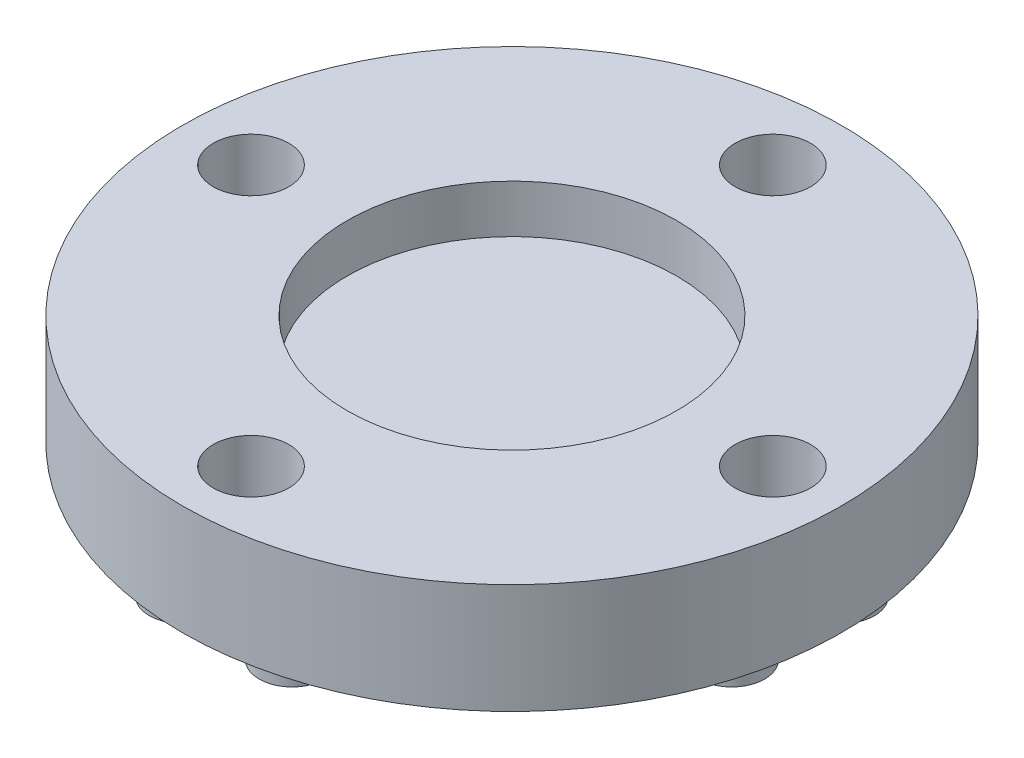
ISO-10303-21;
HEADER;
FILE_DESCRIPTION(('STEP AP214'),'2;1');
FILE_NAME('part.step','',(''),(''),'','','');
FILE_SCHEMA(('AUTOMOTIVE_DESIGN { 1 0 10303 214 1 1 1 1 }'));
ENDSEC;
DATA;
#1=APPLICATION_CONTEXT('core data for automotive mechanical design processes');
#2=APPLICATION_PROTOCOL_DEFINITION('international standard','automotive_design',2000,#1);
#3=PRODUCT_CONTEXT('',#1,'mechanical');
#4=PRODUCT('Part','Part','',(#3));
#5=PRODUCT_RELATED_PRODUCT_CATEGORY('part','',(#4));
#6=PRODUCT_DEFINITION_FORMATION('','',#4);
#7=PRODUCT_DEFINITION_CONTEXT('part definition',#1,'design');
#8=PRODUCT_DEFINITION('design','',#6,#7);
#9=PRODUCT_DEFINITION_SHAPE('','',#8);
#10=(LENGTH_UNIT() NAMED_UNIT(*) SI_UNIT(.MILLI.,.METRE.));
#11=(NAMED_UNIT(*) PLANE_ANGLE_UNIT() SI_UNIT($,.RADIAN.));
#12=(NAMED_UNIT(*) SI_UNIT($,.STERADIAN.) SOLID_ANGLE_UNIT());
#13=UNCERTAINTY_MEASURE_WITH_UNIT(LENGTH_MEASURE(1.E-05),#10,'distance_accuracy_value','');
#14=(GEOMETRIC_REPRESENTATION_CONTEXT(3) GLOBAL_UNCERTAINTY_ASSIGNED_CONTEXT((#13)) GLOBAL_UNIT_ASSIGNED_CONTEXT((#10,
#11,#12)) REPRESENTATION_CONTEXT('',''));
#15=CARTESIAN_POINT('',(0.,0.,0.));
#16=DIRECTION('',(0.,0.,1.));
#17=DIRECTION('',(1.,0.,0.));
#18=AXIS2_PLACEMENT_3D('',#15,#16,#17);
#19=CARTESIAN_POINT('',(0.,8.,0.));
#20=DIRECTION('',(0.,-1.,0.));
#21=DIRECTION('',(0.,0.,-1.));
#22=AXIS2_PLACEMENT_3D('',#19,#20,#21);
#23=CYLINDRICAL_SURFACE('',#22,24.);
#24=CARTESIAN_POINT('',(0.,8.,0.));
#25=DIRECTION('',(0.,1.,0.));
#26=DIRECTION('',(0.,0.,1.));
#27=AXIS2_PLACEMENT_3D('',#24,#25,#26);
#28=CIRCLE('',#27,24.);
#29=CARTESIAN_POINT('',(0.,8.,24.));
#30=VERTEX_POINT('',#29);
#31=EDGE_CURVE('E112',#30,#30,#28,.T.);
#32=ORIENTED_EDGE('',*,*,#31,.F.);
#33=EDGE_LOOP('',(#32));
#34=FACE_BOUND('',#33,.T.);
#35=CARTESIAN_POINT('',(0.,0.,0.));
#36=DIRECTION('',(0.,1.,0.));
#37=DIRECTION('',(0.,0.,1.));
#38=AXIS2_PLACEMENT_3D('',#35,#36,#37);
#39=CIRCLE('',#38,24.);
#40=CARTESIAN_POINT('',(0.,0.,24.));
#41=VERTEX_POINT('',#40);
#42=EDGE_CURVE('E113',#41,#41,#39,.T.);
#43=ORIENTED_EDGE('',*,*,#42,.T.);
#44=EDGE_LOOP('',(#43));
#45=FACE_BOUND('',#44,.T.);
#46=ADVANCED_FACE('F33',(#34,#45),#23,.T.);
#47=CARTESIAN_POINT('',(0.,8.,0.));
#48=DIRECTION('',(0.,1.,0.));
#49=DIRECTION('',(0.,0.,1.));
#50=AXIS2_PLACEMENT_3D('',#47,#48,#49);
#51=PLANE('',#50);
#52=CARTESIAN_POINT('',(-1.99014436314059E-13,8.,19.));
#53=DIRECTION('',(0.,1.,0.));
#54=DIRECTION('',(0.,0.,1.));
#55=AXIS2_PLACEMENT_3D('',#52,#53,#54);
#56=CIRCLE('',#55,2.75);
#57=CARTESIAN_POINT('',(-1.99014436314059E-13,8.,21.75));
#58=VERTEX_POINT('',#57);
#59=EDGE_CURVE('E215',#58,#58,#56,.T.);
#60=ORIENTED_EDGE('',*,*,#59,.F.);
#61=EDGE_LOOP('',(#60));
#62=FACE_BOUND('',#61,.T.);
#63=CARTESIAN_POINT('',(19.,8.,1.32676290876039E-13));
#64=DIRECTION('',(0.,1.,0.));
#65=DIRECTION('',(0.,0.,1.));
#66=AXIS2_PLACEMENT_3D('',#63,#64,#65);
#67=CIRCLE('',#66,2.75);
#68=CARTESIAN_POINT('',(19.,8.,2.75000000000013));
#69=VERTEX_POINT('',#68);
#70=EDGE_CURVE('E209',#69,#69,#67,.T.);
#71=ORIENTED_EDGE('',*,*,#70,.F.);
#72=EDGE_LOOP('',(#71));
#73=FACE_BOUND('',#72,.T.);
#74=CARTESIAN_POINT('',(0.,8.,-19.));
#75=DIRECTION('',(0.,1.,0.));
#76=DIRECTION('',(0.,0.,1.));
#77=AXIS2_PLACEMENT_3D('',#74,#75,#76);
#78=CIRCLE('',#77,2.75);
#79=CARTESIAN_POINT('',(0.,8.,-16.25));
#80=VERTEX_POINT('',#79);
#81=EDGE_CURVE('E203',#80,#80,#78,.T.);
#82=ORIENTED_EDGE('',*,*,#81,.F.);
#83=EDGE_LOOP('',(#82));
#84=FACE_BOUND('',#83,.T.);
#85=CARTESIAN_POINT('',(-19.,8.,0.));
#86=DIRECTION('',(0.,1.,0.));
#87=DIRECTION('',(0.,0.,1.));
#88=AXIS2_PLACEMENT_3D('',#85,#86,#87);
#89=CIRCLE('',#88,2.75);
#90=CARTESIAN_POINT('',(-19.,8.,2.75));
#91=VERTEX_POINT('',#90);
#92=EDGE_CURVE('E197',#91,#91,#89,.T.);
#93=ORIENTED_EDGE('',*,*,#92,.F.);
#94=EDGE_LOOP('',(#93));
#95=FACE_BOUND('',#94,.T.);
#96=CARTESIAN_POINT('',(0.,8.,0.));
#97=DIRECTION('',(0.,1.,0.));
#98=DIRECTION('',(0.,0.,1.));
#99=AXIS2_PLACEMENT_3D('',#96,#97,#98);
#100=CIRCLE('',#99,12.);
#101=CARTESIAN_POINT('',(0.,8.,12.));
#102=VERTEX_POINT('',#101);
#103=EDGE_CURVE('E191',#102,#102,#100,.T.);
#104=ORIENTED_EDGE('',*,*,#103,.F.);
#105=EDGE_LOOP('',(#104));
#106=FACE_BOUND('',#105,.T.);
#107=ORIENTED_EDGE('',*,*,#31,.T.);
#108=EDGE_LOOP('',(#107));
#109=FACE_BOUND('',#108,.T.);
#110=ADVANCED_FACE('F230',(#62,#73,#84,#95,#106,#109),#51,.T.);
#111=CARTESIAN_POINT('',(0.,0.,0.));
#112=DIRECTION('',(0.,1.,0.));
#113=DIRECTION('',(0.,0.,1.));
#114=AXIS2_PLACEMENT_3D('',#111,#112,#113);
#115=PLANE('',#114);
#116=CARTESIAN_POINT('',(-20.0000000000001,0.,4.));
#117=DIRECTION('',(0.,1.,0.));
#118=DIRECTION('',(0.,0.,1.));
#119=AXIS2_PLACEMENT_3D('',#116,#117,#118);
#120=CIRCLE('',#119,2.41);
#121=CARTESIAN_POINT('',(-20.0000000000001,0.,6.40999999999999));
#122=VERTEX_POINT('',#121);
#123=EDGE_CURVE('E10',#122,#122,#120,.F.);
#124=ORIENTED_EDGE('',*,*,#123,.F.);
#125=EDGE_LOOP('',(#124));
#126=FACE_BOUND('',#125,.T.);
#127=CARTESIAN_POINT('',(-20.0000000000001,0.,-4.));
#128=DIRECTION('',(0.,1.,0.));
#129=DIRECTION('',(0.,0.,1.));
#130=AXIS2_PLACEMENT_3D('',#127,#128,#129);
#131=CIRCLE('',#130,2.41);
#132=CARTESIAN_POINT('',(-20.0000000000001,0.,-1.59000000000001));
#133=VERTEX_POINT('',#132);
#134=EDGE_CURVE('E39',#133,#133,#131,.F.);
#135=ORIENTED_EDGE('',*,*,#134,.F.);
#136=EDGE_LOOP('',(#135));
#137=FACE_BOUND('',#136,.T.);
#138=CARTESIAN_POINT('',(3.99999999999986,0.,20.));
#139=DIRECTION('',(0.,1.,0.));
#140=DIRECTION('',(0.,0.,1.));
#141=AXIS2_PLACEMENT_3D('',#138,#139,#140);
#142=CIRCLE('',#141,2.41);
#143=CARTESIAN_POINT('',(3.99999999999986,0.,22.41));
#144=VERTEX_POINT('',#143);
#145=EDGE_CURVE('E43',#144,#144,#142,.F.);
#146=ORIENTED_EDGE('',*,*,#145,.F.);
#147=EDGE_LOOP('',(#146));
#148=FACE_BOUND('',#147,.T.);
#149=CARTESIAN_POINT('',(-4.00000000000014,0.,20.));
#150=DIRECTION('',(0.,1.,0.));
#151=DIRECTION('',(0.,0.,1.));
#152=AXIS2_PLACEMENT_3D('',#149,#150,#151);
#153=CIRCLE('',#152,2.41);
#154=CARTESIAN_POINT('',(-4.00000000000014,0.,22.41));
#155=VERTEX_POINT('',#154);
#156=EDGE_CURVE('E47',#155,#155,#153,.F.);
#157=ORIENTED_EDGE('',*,*,#156,.F.);
#158=EDGE_LOOP('',(#157));
#159=FACE_BOUND('',#158,.T.);
#160=CARTESIAN_POINT('',(11.9999999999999,0.,12.));
#161=DIRECTION('',(0.,1.,0.));
#162=DIRECTION('',(0.,0.,1.));
#163=AXIS2_PLACEMENT_3D('',#160,#161,#162);
#164=CIRCLE('',#163,2.41);
#165=CARTESIAN_POINT('',(11.9999999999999,0.,14.41));
#166=VERTEX_POINT('',#165);
#167=EDGE_CURVE('E52',#166,#166,#164,.F.);
#168=ORIENTED_EDGE('',*,*,#167,.F.);
#169=EDGE_LOOP('',(#168));
#170=FACE_BOUND('',#169,.T.);
#171=CARTESIAN_POINT('',(3.99999999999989,0.,12.));
#172=DIRECTION('',(0.,1.,0.));
#173=DIRECTION('',(0.,0.,1.));
#174=AXIS2_PLACEMENT_3D('',#171,#172,#173);
#175=CIRCLE('',#174,2.41);
#176=CARTESIAN_POINT('',(3.99999999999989,0.,14.41));
#177=VERTEX_POINT('',#176);
#178=EDGE_CURVE('E55',#177,#177,#175,.F.);
#179=ORIENTED_EDGE('',*,*,#178,.F.);
#180=EDGE_LOOP('',(#179));
#181=FACE_BOUND('',#180,.T.);
#182=CARTESIAN_POINT('',(-4.00000000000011,0.,12.));
#183=DIRECTION('',(0.,1.,0.));
#184=DIRECTION('',(0.,0.,1.));
#185=AXIS2_PLACEMENT_3D('',#182,#183,#184);
#186=CIRCLE('',#185,2.41);
#187=CARTESIAN_POINT('',(-4.00000000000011,0.,14.41));
#188=VERTEX_POINT('',#187);
#189=EDGE_CURVE('E58',#188,#188,#186,.F.);
#190=ORIENTED_EDGE('',*,*,#189,.F.);
#191=EDGE_LOOP('',(#190));
#192=FACE_BOUND('',#191,.T.);
#193=CARTESIAN_POINT('',(-12.0000000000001,0.,12.));
#194=DIRECTION('',(0.,1.,0.));
#195=DIRECTION('',(0.,0.,1.));
#196=AXIS2_PLACEMENT_3D('',#193,#194,#195);
#197=CIRCLE('',#196,2.41);
#198=CARTESIAN_POINT('',(-12.0000000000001,0.,14.41));
#199=VERTEX_POINT('',#198);
#200=EDGE_CURVE('E61',#199,#199,#197,.F.);
#201=ORIENTED_EDGE('',*,*,#200,.F.);
#202=EDGE_LOOP('',(#201));
#203=FACE_BOUND('',#202,.T.);
#204=CARTESIAN_POINT('',(19.9999999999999,0.,4.));
#205=DIRECTION('',(0.,1.,0.));
#206=DIRECTION('',(0.,0.,1.));
#207=AXIS2_PLACEMENT_3D('',#204,#205,#206);
#208=CIRCLE('',#207,2.41);
#209=CARTESIAN_POINT('',(19.9999999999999,0.,6.40999999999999));
#210=VERTEX_POINT('',#209);
#211=EDGE_CURVE('E64',#210,#210,#208,.F.);
#212=ORIENTED_EDGE('',*,*,#211,.F.);
#213=EDGE_LOOP('',(#212));
#214=FACE_BOUND('',#213,.T.);
#215=CARTESIAN_POINT('',(11.9999999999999,0.,4.));
#216=DIRECTION('',(0.,1.,0.));
#217=DIRECTION('',(0.,0.,1.));
#218=AXIS2_PLACEMENT_3D('',#215,#216,#217);
#219=CIRCLE('',#218,2.41);
#220=CARTESIAN_POINT('',(11.9999999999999,0.,6.41));
#221=VERTEX_POINT('',#220);
#222=EDGE_CURVE('E67',#221,#221,#219,.F.);
#223=ORIENTED_EDGE('',*,*,#222,.F.);
#224=EDGE_LOOP('',(#223));
#225=FACE_BOUND('',#224,.T.);
#226=CARTESIAN_POINT('',(3.99999999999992,0.,4.));
#227=DIRECTION('',(0.,1.,0.));
#228=DIRECTION('',(0.,0.,1.));
#229=AXIS2_PLACEMENT_3D('',#226,#227,#228);
#230=CIRCLE('',#229,2.41);
#231=CARTESIAN_POINT('',(3.99999999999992,0.,6.41));
#232=VERTEX_POINT('',#231);
#233=EDGE_CURVE('E70',#232,#232,#230,.F.);
#234=ORIENTED_EDGE('',*,*,#233,.F.);
#235=EDGE_LOOP('',(#234));
#236=FACE_BOUND('',#235,.T.);
#237=CARTESIAN_POINT('',(-4.00000000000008,0.,4.));
#238=DIRECTION('',(0.,1.,0.));
#239=DIRECTION('',(0.,0.,1.));
#240=AXIS2_PLACEMENT_3D('',#237,#238,#239);
#241=CIRCLE('',#240,2.41);
#242=CARTESIAN_POINT('',(-4.00000000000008,0.,6.41));
#243=VERTEX_POINT('',#242);
#244=EDGE_CURVE('E73',#243,#243,#241,.F.);
#245=ORIENTED_EDGE('',*,*,#244,.F.);
#246=EDGE_LOOP('',(#245));
#247=FACE_BOUND('',#246,.T.);
#248=CARTESIAN_POINT('',(-12.0000000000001,0.,4.));
#249=DIRECTION('',(0.,1.,0.));
#250=DIRECTION('',(0.,0.,1.));
#251=AXIS2_PLACEMENT_3D('',#248,#249,#250);
#252=CIRCLE('',#251,2.41);
#253=CARTESIAN_POINT('',(-12.0000000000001,0.,6.41));
#254=VERTEX_POINT('',#253);
#255=EDGE_CURVE('E76',#254,#254,#252,.F.);
#256=ORIENTED_EDGE('',*,*,#255,.F.);
#257=EDGE_LOOP('',(#256));
#258=FACE_BOUND('',#257,.T.);
#259=CARTESIAN_POINT('',(19.9999999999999,0.,-4.));
#260=DIRECTION('',(0.,1.,0.));
#261=DIRECTION('',(0.,0.,1.));
#262=AXIS2_PLACEMENT_3D('',#259,#260,#261);
#263=CIRCLE('',#262,2.41);
#264=CARTESIAN_POINT('',(19.9999999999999,0.,-1.59000000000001));
#265=VERTEX_POINT('',#264);
#266=EDGE_CURVE('E79',#265,#265,#263,.F.);
#267=ORIENTED_EDGE('',*,*,#266,.F.);
#268=EDGE_LOOP('',(#267));
#269=FACE_BOUND('',#268,.T.);
#270=CARTESIAN_POINT('',(11.9999999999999,0.,-4.));
#271=DIRECTION('',(0.,1.,0.));
#272=DIRECTION('',(0.,0.,1.));
#273=AXIS2_PLACEMENT_3D('',#270,#271,#272);
#274=CIRCLE('',#273,2.41);
#275=CARTESIAN_POINT('',(11.9999999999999,0.,-1.59));
#276=VERTEX_POINT('',#275);
#277=EDGE_CURVE('E82',#276,#276,#274,.F.);
#278=ORIENTED_EDGE('',*,*,#277,.F.);
#279=EDGE_LOOP('',(#278));
#280=FACE_BOUND('',#279,.T.);
#281=CARTESIAN_POINT('',(3.99999999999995,0.,-4.));
#282=DIRECTION('',(0.,1.,0.));
#283=DIRECTION('',(0.,0.,1.));
#284=AXIS2_PLACEMENT_3D('',#281,#282,#283);
#285=CIRCLE('',#284,2.41);
#286=CARTESIAN_POINT('',(3.99999999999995,0.,-1.59));
#287=VERTEX_POINT('',#286);
#288=EDGE_CURVE('E85',#287,#287,#285,.F.);
#289=ORIENTED_EDGE('',*,*,#288,.F.);
#290=EDGE_LOOP('',(#289));
#291=FACE_BOUND('',#290,.T.);
#292=CARTESIAN_POINT('',(-4.00000000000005,0.,-4.));
#293=DIRECTION('',(0.,1.,0.));
#294=DIRECTION('',(0.,0.,1.));
#295=AXIS2_PLACEMENT_3D('',#292,#293,#294);
#296=CIRCLE('',#295,2.41);
#297=CARTESIAN_POINT('',(-4.00000000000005,0.,-1.59));
#298=VERTEX_POINT('',#297);
#299=EDGE_CURVE('E88',#298,#298,#296,.F.);
#300=ORIENTED_EDGE('',*,*,#299,.F.);
#301=EDGE_LOOP('',(#300));
#302=FACE_BOUND('',#301,.T.);
#303=CARTESIAN_POINT('',(-12.0000000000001,0.,-4.));
#304=DIRECTION('',(0.,1.,0.));
#305=DIRECTION('',(0.,0.,1.));
#306=AXIS2_PLACEMENT_3D('',#303,#304,#305);
#307=CIRCLE('',#306,2.41);
#308=CARTESIAN_POINT('',(-12.0000000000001,0.,-1.59));
#309=VERTEX_POINT('',#308);
#310=EDGE_CURVE('E91',#309,#309,#307,.F.);
#311=ORIENTED_EDGE('',*,*,#310,.F.);
#312=EDGE_LOOP('',(#311));
#313=FACE_BOUND('',#312,.T.);
#314=CARTESIAN_POINT('',(12.,0.,-12.));
#315=DIRECTION('',(0.,1.,0.));
#316=DIRECTION('',(0.,0.,1.));
#317=AXIS2_PLACEMENT_3D('',#314,#315,#316);
#318=CIRCLE('',#317,2.41);
#319=CARTESIAN_POINT('',(12.,0.,-9.59));
#320=VERTEX_POINT('',#319);
#321=EDGE_CURVE('E94',#320,#320,#318,.F.);
#322=ORIENTED_EDGE('',*,*,#321,.F.);
#323=EDGE_LOOP('',(#322));
#324=FACE_BOUND('',#323,.T.);
#325=CARTESIAN_POINT('',(3.99999999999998,0.,-12.));
#326=DIRECTION('',(0.,1.,0.));
#327=DIRECTION('',(0.,0.,1.));
#328=AXIS2_PLACEMENT_3D('',#325,#326,#327);
#329=CIRCLE('',#328,2.41);
#330=CARTESIAN_POINT('',(3.99999999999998,0.,-9.59));
#331=VERTEX_POINT('',#330);
#332=EDGE_CURVE('E97',#331,#331,#329,.F.);
#333=ORIENTED_EDGE('',*,*,#332,.F.);
#334=EDGE_LOOP('',(#333));
#335=FACE_BOUND('',#334,.T.);
#336=CARTESIAN_POINT('',(-4.00000000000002,0.,-12.));
#337=DIRECTION('',(0.,1.,0.));
#338=DIRECTION('',(0.,0.,1.));
#339=AXIS2_PLACEMENT_3D('',#336,#337,#338);
#340=CIRCLE('',#339,2.41);
#341=CARTESIAN_POINT('',(-4.00000000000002,0.,-9.59));
#342=VERTEX_POINT('',#341);
#343=EDGE_CURVE('E100',#342,#342,#340,.F.);
#344=ORIENTED_EDGE('',*,*,#343,.F.);
#345=EDGE_LOOP('',(#344));
#346=FACE_BOUND('',#345,.T.);
#347=CARTESIAN_POINT('',(-12.,0.,-12.));
#348=DIRECTION('',(0.,1.,0.));
#349=DIRECTION('',(0.,0.,1.));
#350=AXIS2_PLACEMENT_3D('',#347,#348,#349);
#351=CIRCLE('',#350,2.41);
#352=CARTESIAN_POINT('',(-12.,0.,-9.59));
#353=VERTEX_POINT('',#352);
#354=EDGE_CURVE('E103',#353,#353,#351,.F.);
#355=ORIENTED_EDGE('',*,*,#354,.F.);
#356=EDGE_LOOP('',(#355));
#357=FACE_BOUND('',#356,.T.);
#358=CARTESIAN_POINT('',(4.,0.,-20.));
#359=DIRECTION('',(0.,1.,0.));
#360=DIRECTION('',(0.,0.,1.));
#361=AXIS2_PLACEMENT_3D('',#358,#359,#360);
#362=CIRCLE('',#361,2.41);
#363=CARTESIAN_POINT('',(4.,0.,-17.59));
#364=VERTEX_POINT('',#363);
#365=EDGE_CURVE('E106',#364,#364,#362,.F.);
#366=ORIENTED_EDGE('',*,*,#365,.F.);
#367=EDGE_LOOP('',(#366));
#368=FACE_BOUND('',#367,.T.);
#369=CARTESIAN_POINT('',(-4.,0.,-20.));
#370=DIRECTION('',(0.,1.,0.));
#371=DIRECTION('',(0.,0.,1.));
#372=AXIS2_PLACEMENT_3D('',#369,#370,#371);
#373=CIRCLE('',#372,2.41);
#374=CARTESIAN_POINT('',(-4.,0.,-17.59));
#375=VERTEX_POINT('',#374);
#376=EDGE_CURVE('E109',#375,#375,#373,.F.);
#377=ORIENTED_EDGE('',*,*,#376,.F.);
#378=EDGE_LOOP('',(#377));
#379=FACE_BOUND('',#378,.T.);
#380=ORIENTED_EDGE('',*,*,#42,.F.);
#381=EDGE_LOOP('',(#380));
#382=FACE_BOUND('',#381,.T.);
#383=ADVANCED_FACE('F233',(#126,#137,#148,#159,#170,#181,#192,#203,#214,#225,#236,#247,#258,
#269,#280,#291,#302,#313,#324,#335,#346,#357,#368,#379,#382),#115,.F.);
#384=CARTESIAN_POINT('',(-4.,-1.72,-20.));
#385=DIRECTION('',(0.,1.,0.));
#386=DIRECTION('',(0.,0.,1.));
#387=AXIS2_PLACEMENT_3D('',#384,#385,#386);
#388=CYLINDRICAL_SURFACE('',#387,2.41);
#389=CARTESIAN_POINT('',(-4.,-1.72,-20.));
#390=DIRECTION('',(0.,-1.,0.));
#391=DIRECTION('',(0.,0.,-1.));
#392=AXIS2_PLACEMENT_3D('',#389,#390,#391);
#393=CIRCLE('',#392,2.41);
#394=CARTESIAN_POINT('',(-4.,-1.72,-22.41));
#395=VERTEX_POINT('',#394);
#396=EDGE_CURVE('E116',#395,#395,#393,.T.);
#397=ORIENTED_EDGE('',*,*,#396,.F.);
#398=EDGE_LOOP('',(#397));
#399=FACE_BOUND('',#398,.T.);
#400=ORIENTED_EDGE('',*,*,#376,.T.);
#401=EDGE_LOOP('',(#400));
#402=FACE_BOUND('',#401,.T.);
#403=ADVANCED_FACE('F250',(#399,#402),#388,.T.);
#404=CARTESIAN_POINT('',(-4.,-1.72,-20.));
#405=DIRECTION('',(0.,-1.,0.));
#406=DIRECTION('',(0.,0.,-1.));
#407=AXIS2_PLACEMENT_3D('',#404,#405,#406);
#408=PLANE('',#407);
#409=ORIENTED_EDGE('',*,*,#396,.T.);
#410=EDGE_LOOP('',(#409));
#411=FACE_BOUND('',#410,.T.);
#412=ADVANCED_FACE('F255',(#411),#408,.T.);
#413=CARTESIAN_POINT('',(4.,-1.72,-20.));
#414=DIRECTION('',(0.,1.,0.));
#415=DIRECTION('',(0.,0.,1.));
#416=AXIS2_PLACEMENT_3D('',#413,#414,#415);
#417=CYLINDRICAL_SURFACE('',#416,2.41);
#418=CARTESIAN_POINT('',(4.,-1.72,-20.));
#419=DIRECTION('',(0.,-1.,0.));
#420=DIRECTION('',(0.,0.,-1.));
#421=AXIS2_PLACEMENT_3D('',#418,#419,#420);
#422=CIRCLE('',#421,2.41);
#423=CARTESIAN_POINT('',(4.,-1.72,-22.41));
#424=VERTEX_POINT('',#423);
#425=EDGE_CURVE('E121',#424,#424,#422,.T.);
#426=ORIENTED_EDGE('',*,*,#425,.F.);
#427=EDGE_LOOP('',(#426));
#428=FACE_BOUND('',#427,.T.);
#429=ORIENTED_EDGE('',*,*,#365,.T.);
#430=EDGE_LOOP('',(#429));
#431=FACE_BOUND('',#430,.T.);
#432=ADVANCED_FACE('F262',(#428,#431),#417,.T.);
#433=CARTESIAN_POINT('',(4.,-1.72,-20.));
#434=DIRECTION('',(0.,-1.,0.));
#435=DIRECTION('',(0.,0.,-1.));
#436=AXIS2_PLACEMENT_3D('',#433,#434,#435);
#437=PLANE('',#436);
#438=ORIENTED_EDGE('',*,*,#425,.T.);
#439=EDGE_LOOP('',(#438));
#440=FACE_BOUND('',#439,.T.);
#441=ADVANCED_FACE('F266',(#440),#437,.T.);
#442=CARTESIAN_POINT('',(-12.,-1.72,-12.));
#443=DIRECTION('',(0.,1.,0.));
#444=DIRECTION('',(0.,0.,1.));
#445=AXIS2_PLACEMENT_3D('',#442,#443,#444);
#446=CYLINDRICAL_SURFACE('',#445,2.41);
#447=CARTESIAN_POINT('',(-12.,-1.72,-12.));
#448=DIRECTION('',(0.,-1.,0.));
#449=DIRECTION('',(0.,0.,-1.));
#450=AXIS2_PLACEMENT_3D('',#447,#448,#449);
#451=CIRCLE('',#450,2.41);
#452=CARTESIAN_POINT('',(-12.,-1.72,-14.41));
#453=VERTEX_POINT('',#452);
#454=EDGE_CURVE('E124',#453,#453,#451,.T.);
#455=ORIENTED_EDGE('',*,*,#454,.F.);
#456=EDGE_LOOP('',(#455));
#457=FACE_BOUND('',#456,.T.);
#458=ORIENTED_EDGE('',*,*,#354,.T.);
#459=EDGE_LOOP('',(#458));
#460=FACE_BOUND('',#459,.T.);
#461=ADVANCED_FACE('F270',(#457,#460),#446,.T.);
#462=CARTESIAN_POINT('',(-12.,-1.72,-12.));
#463=DIRECTION('',(0.,-1.,0.));
#464=DIRECTION('',(0.,0.,-1.));
#465=AXIS2_PLACEMENT_3D('',#462,#463,#464);
#466=PLANE('',#465);
#467=ORIENTED_EDGE('',*,*,#454,.T.);
#468=EDGE_LOOP('',(#467));
#469=FACE_BOUND('',#468,.T.);
#470=ADVANCED_FACE('F274',(#469),#466,.T.);
#471=CARTESIAN_POINT('',(-4.00000000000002,-1.72,-12.));
#472=DIRECTION('',(0.,1.,0.));
#473=DIRECTION('',(0.,0.,1.));
#474=AXIS2_PLACEMENT_3D('',#471,#472,#473);
#475=CYLINDRICAL_SURFACE('',#474,2.41);
#476=CARTESIAN_POINT('',(-4.00000000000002,-1.72,-12.));
#477=DIRECTION('',(0.,-1.,0.));
#478=DIRECTION('',(0.,0.,-1.));
#479=AXIS2_PLACEMENT_3D('',#476,#477,#478);
#480=CIRCLE('',#479,2.41);
#481=CARTESIAN_POINT('',(-4.00000000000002,-1.72,-14.41));
#482=VERTEX_POINT('',#481);
#483=EDGE_CURVE('E127',#482,#482,#480,.T.);
#484=ORIENTED_EDGE('',*,*,#483,.F.);
#485=EDGE_LOOP('',(#484));
#486=FACE_BOUND('',#485,.T.);
#487=ORIENTED_EDGE('',*,*,#343,.T.);
#488=EDGE_LOOP('',(#487));
#489=FACE_BOUND('',#488,.T.);
#490=ADVANCED_FACE('F278',(#486,#489),#475,.T.);
#491=CARTESIAN_POINT('',(-4.00000000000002,-1.72,-12.));
#492=DIRECTION('',(0.,-1.,0.));
#493=DIRECTION('',(0.,0.,-1.));
#494=AXIS2_PLACEMENT_3D('',#491,#492,#493);
#495=PLANE('',#494);
#496=ORIENTED_EDGE('',*,*,#483,.T.);
#497=EDGE_LOOP('',(#496));
#498=FACE_BOUND('',#497,.T.);
#499=ADVANCED_FACE('F282',(#498),#495,.T.);
#500=CARTESIAN_POINT('',(3.99999999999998,-1.72,-12.));
#501=DIRECTION('',(0.,1.,0.));
#502=DIRECTION('',(0.,0.,1.));
#503=AXIS2_PLACEMENT_3D('',#500,#501,#502);
#504=CYLINDRICAL_SURFACE('',#503,2.41);
#505=CARTESIAN_POINT('',(3.99999999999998,-1.72,-12.));
#506=DIRECTION('',(0.,-1.,0.));
#507=DIRECTION('',(0.,0.,-1.));
#508=AXIS2_PLACEMENT_3D('',#505,#506,#507);
#509=CIRCLE('',#508,2.41);
#510=CARTESIAN_POINT('',(3.99999999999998,-1.72,-14.41));
#511=VERTEX_POINT('',#510);
#512=EDGE_CURVE('E130',#511,#511,#509,.T.);
#513=ORIENTED_EDGE('',*,*,#512,.F.);
#514=EDGE_LOOP('',(#513));
#515=FACE_BOUND('',#514,.T.);
#516=ORIENTED_EDGE('',*,*,#332,.T.);
#517=EDGE_LOOP('',(#516));
#518=FACE_BOUND('',#517,.T.);
#519=ADVANCED_FACE('F286',(#515,#518),#504,.T.);
#520=CARTESIAN_POINT('',(3.99999999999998,-1.72,-12.));
#521=DIRECTION('',(0.,-1.,0.));
#522=DIRECTION('',(0.,0.,-1.));
#523=AXIS2_PLACEMENT_3D('',#520,#521,#522);
#524=PLANE('',#523);
#525=ORIENTED_EDGE('',*,*,#512,.T.);
#526=EDGE_LOOP('',(#525));
#527=FACE_BOUND('',#526,.T.);
#528=ADVANCED_FACE('F290',(#527),#524,.T.);
#529=CARTESIAN_POINT('',(12.,-1.72,-12.));
#530=DIRECTION('',(0.,1.,0.));
#531=DIRECTION('',(0.,0.,1.));
#532=AXIS2_PLACEMENT_3D('',#529,#530,#531);
#533=CYLINDRICAL_SURFACE('',#532,2.41);
#534=CARTESIAN_POINT('',(12.,-1.72,-12.));
#535=DIRECTION('',(0.,-1.,0.));
#536=DIRECTION('',(0.,0.,-1.));
#537=AXIS2_PLACEMENT_3D('',#534,#535,#536);
#538=CIRCLE('',#537,2.41);
#539=CARTESIAN_POINT('',(12.,-1.72,-14.41));
#540=VERTEX_POINT('',#539);
#541=EDGE_CURVE('E133',#540,#540,#538,.T.);
#542=ORIENTED_EDGE('',*,*,#541,.F.);
#543=EDGE_LOOP('',(#542));
#544=FACE_BOUND('',#543,.T.);
#545=ORIENTED_EDGE('',*,*,#321,.T.);
#546=EDGE_LOOP('',(#545));
#547=FACE_BOUND('',#546,.T.);
#548=ADVANCED_FACE('F294',(#544,#547),#533,.T.);
#549=CARTESIAN_POINT('',(12.,-1.72,-12.));
#550=DIRECTION('',(0.,-1.,0.));
#551=DIRECTION('',(0.,0.,-1.));
#552=AXIS2_PLACEMENT_3D('',#549,#550,#551);
#553=PLANE('',#552);
#554=ORIENTED_EDGE('',*,*,#541,.T.);
#555=EDGE_LOOP('',(#554));
#556=FACE_BOUND('',#555,.T.);
#557=ADVANCED_FACE('F298',(#556),#553,.T.);
#558=CARTESIAN_POINT('',(-12.0000000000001,-1.72,-4.));
#559=DIRECTION('',(0.,1.,0.));
#560=DIRECTION('',(0.,0.,1.));
#561=AXIS2_PLACEMENT_3D('',#558,#559,#560);
#562=CYLINDRICAL_SURFACE('',#561,2.41);
#563=CARTESIAN_POINT('',(-12.0000000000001,-1.72,-4.));
#564=DIRECTION('',(0.,-1.,0.));
#565=DIRECTION('',(0.,0.,-1.));
#566=AXIS2_PLACEMENT_3D('',#563,#564,#565);
#567=CIRCLE('',#566,2.41);
#568=CARTESIAN_POINT('',(-12.0000000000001,-1.72,-6.41));
#569=VERTEX_POINT('',#568);
#570=EDGE_CURVE('E136',#569,#569,#567,.T.);
#571=ORIENTED_EDGE('',*,*,#570,.F.);
#572=EDGE_LOOP('',(#571));
#573=FACE_BOUND('',#572,.T.);
#574=ORIENTED_EDGE('',*,*,#310,.T.);
#575=EDGE_LOOP('',(#574));
#576=FACE_BOUND('',#575,.T.);
#577=ADVANCED_FACE('F302',(#573,#576),#562,.T.);
#578=CARTESIAN_POINT('',(-12.0000000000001,-1.72,-4.));
#579=DIRECTION('',(0.,-1.,0.));
#580=DIRECTION('',(0.,0.,-1.));
#581=AXIS2_PLACEMENT_3D('',#578,#579,#580);
#582=PLANE('',#581);
#583=ORIENTED_EDGE('',*,*,#570,.T.);
#584=EDGE_LOOP('',(#583));
#585=FACE_BOUND('',#584,.T.);
#586=ADVANCED_FACE('F306',(#585),#582,.T.);
#587=CARTESIAN_POINT('',(-4.00000000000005,-1.72,-4.));
#588=DIRECTION('',(0.,1.,0.));
#589=DIRECTION('',(0.,0.,1.));
#590=AXIS2_PLACEMENT_3D('',#587,#588,#589);
#591=CYLINDRICAL_SURFACE('',#590,2.41);
#592=CARTESIAN_POINT('',(-4.00000000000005,-1.72,-4.));
#593=DIRECTION('',(0.,-1.,0.));
#594=DIRECTION('',(0.,0.,-1.));
#595=AXIS2_PLACEMENT_3D('',#592,#593,#594);
#596=CIRCLE('',#595,2.41);
#597=CARTESIAN_POINT('',(-4.00000000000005,-1.72,-6.41));
#598=VERTEX_POINT('',#597);
#599=EDGE_CURVE('E139',#598,#598,#596,.T.);
#600=ORIENTED_EDGE('',*,*,#599,.F.);
#601=EDGE_LOOP('',(#600));
#602=FACE_BOUND('',#601,.T.);
#603=ORIENTED_EDGE('',*,*,#299,.T.);
#604=EDGE_LOOP('',(#603));
#605=FACE_BOUND('',#604,.T.);
#606=ADVANCED_FACE('F310',(#602,#605),#591,.T.);
#607=CARTESIAN_POINT('',(-4.00000000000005,-1.72,-4.));
#608=DIRECTION('',(0.,-1.,0.));
#609=DIRECTION('',(0.,0.,-1.));
#610=AXIS2_PLACEMENT_3D('',#607,#608,#609);
#611=PLANE('',#610);
#612=ORIENTED_EDGE('',*,*,#599,.T.);
#613=EDGE_LOOP('',(#612));
#614=FACE_BOUND('',#613,.T.);
#615=ADVANCED_FACE('F314',(#614),#611,.T.);
#616=CARTESIAN_POINT('',(3.99999999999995,-1.72,-4.));
#617=DIRECTION('',(0.,1.,0.));
#618=DIRECTION('',(0.,0.,1.));
#619=AXIS2_PLACEMENT_3D('',#616,#617,#618);
#620=CYLINDRICAL_SURFACE('',#619,2.41);
#621=CARTESIAN_POINT('',(3.99999999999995,-1.72,-4.));
#622=DIRECTION('',(0.,-1.,0.));
#623=DIRECTION('',(0.,0.,-1.));
#624=AXIS2_PLACEMENT_3D('',#621,#622,#623);
#625=CIRCLE('',#624,2.41);
#626=CARTESIAN_POINT('',(3.99999999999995,-1.72,-6.41));
#627=VERTEX_POINT('',#626);
#628=EDGE_CURVE('E142',#627,#627,#625,.T.);
#629=ORIENTED_EDGE('',*,*,#628,.F.);
#630=EDGE_LOOP('',(#629));
#631=FACE_BOUND('',#630,.T.);
#632=ORIENTED_EDGE('',*,*,#288,.T.);
#633=EDGE_LOOP('',(#632));
#634=FACE_BOUND('',#633,.T.);
#635=ADVANCED_FACE('F318',(#631,#634),#620,.T.);
#636=CARTESIAN_POINT('',(3.99999999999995,-1.72,-4.));
#637=DIRECTION('',(0.,-1.,0.));
#638=DIRECTION('',(0.,0.,-1.));
#639=AXIS2_PLACEMENT_3D('',#636,#637,#638);
#640=PLANE('',#639);
#641=ORIENTED_EDGE('',*,*,#628,.T.);
#642=EDGE_LOOP('',(#641));
#643=FACE_BOUND('',#642,.T.);
#644=ADVANCED_FACE('F322',(#643),#640,.T.);
#645=CARTESIAN_POINT('',(11.9999999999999,-1.72,-4.));
#646=DIRECTION('',(0.,1.,0.));
#647=DIRECTION('',(0.,0.,1.));
#648=AXIS2_PLACEMENT_3D('',#645,#646,#647);
#649=CYLINDRICAL_SURFACE('',#648,2.41);
#650=CARTESIAN_POINT('',(11.9999999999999,-1.72,-4.));
#651=DIRECTION('',(0.,-1.,0.));
#652=DIRECTION('',(0.,0.,-1.));
#653=AXIS2_PLACEMENT_3D('',#650,#651,#652);
#654=CIRCLE('',#653,2.41);
#655=CARTESIAN_POINT('',(11.9999999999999,-1.72,-6.41));
#656=VERTEX_POINT('',#655);
#657=EDGE_CURVE('E145',#656,#656,#654,.T.);
#658=ORIENTED_EDGE('',*,*,#657,.F.);
#659=EDGE_LOOP('',(#658));
#660=FACE_BOUND('',#659,.T.);
#661=ORIENTED_EDGE('',*,*,#277,.T.);
#662=EDGE_LOOP('',(#661));
#663=FACE_BOUND('',#662,.T.);
#664=ADVANCED_FACE('F326',(#660,#663),#649,.T.);
#665=CARTESIAN_POINT('',(11.9999999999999,-1.72,-4.));
#666=DIRECTION('',(0.,-1.,0.));
#667=DIRECTION('',(0.,0.,-1.));
#668=AXIS2_PLACEMENT_3D('',#665,#666,#667);
#669=PLANE('',#668);
#670=ORIENTED_EDGE('',*,*,#657,.T.);
#671=EDGE_LOOP('',(#670));
#672=FACE_BOUND('',#671,.T.);
#673=ADVANCED_FACE('F330',(#672),#669,.T.);
#674=CARTESIAN_POINT('',(19.9999999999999,-1.72,-4.));
#675=DIRECTION('',(0.,1.,0.));
#676=DIRECTION('',(0.,0.,1.));
#677=AXIS2_PLACEMENT_3D('',#674,#675,#676);
#678=CYLINDRICAL_SURFACE('',#677,2.41);
#679=CARTESIAN_POINT('',(19.9999999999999,-1.72,-4.));
#680=DIRECTION('',(0.,-1.,0.));
#681=DIRECTION('',(0.,0.,-1.));
#682=AXIS2_PLACEMENT_3D('',#679,#680,#681);
#683=CIRCLE('',#682,2.41);
#684=CARTESIAN_POINT('',(19.9999999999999,-1.72,-6.41));
#685=VERTEX_POINT('',#684);
#686=EDGE_CURVE('E148',#685,#685,#683,.T.);
#687=ORIENTED_EDGE('',*,*,#686,.F.);
#688=EDGE_LOOP('',(#687));
#689=FACE_BOUND('',#688,.T.);
#690=ORIENTED_EDGE('',*,*,#266,.T.);
#691=EDGE_LOOP('',(#690));
#692=FACE_BOUND('',#691,.T.);
#693=ADVANCED_FACE('F334',(#689,#692),#678,.T.);
#694=CARTESIAN_POINT('',(19.9999999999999,-1.72,-4.));
#695=DIRECTION('',(0.,-1.,0.));
#696=DIRECTION('',(0.,0.,-1.));
#697=AXIS2_PLACEMENT_3D('',#694,#695,#696);
#698=PLANE('',#697);
#699=ORIENTED_EDGE('',*,*,#686,.T.);
#700=EDGE_LOOP('',(#699));
#701=FACE_BOUND('',#700,.T.);
#702=ADVANCED_FACE('F338',(#701),#698,.T.);
#703=CARTESIAN_POINT('',(-12.0000000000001,-1.72,4.));
#704=DIRECTION('',(0.,1.,0.));
#705=DIRECTION('',(0.,0.,1.));
#706=AXIS2_PLACEMENT_3D('',#703,#704,#705);
#707=CYLINDRICAL_SURFACE('',#706,2.41);
#708=CARTESIAN_POINT('',(-12.0000000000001,-1.72,4.));
#709=DIRECTION('',(0.,-1.,0.));
#710=DIRECTION('',(0.,0.,-1.));
#711=AXIS2_PLACEMENT_3D('',#708,#709,#710);
#712=CIRCLE('',#711,2.41);
#713=CARTESIAN_POINT('',(-12.0000000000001,-1.72,1.59));
#714=VERTEX_POINT('',#713);
#715=EDGE_CURVE('E151',#714,#714,#712,.T.);
#716=ORIENTED_EDGE('',*,*,#715,.F.);
#717=EDGE_LOOP('',(#716));
#718=FACE_BOUND('',#717,.T.);
#719=ORIENTED_EDGE('',*,*,#255,.T.);
#720=EDGE_LOOP('',(#719));
#721=FACE_BOUND('',#720,.T.);
#722=ADVANCED_FACE('F342',(#718,#721),#707,.T.);
#723=CARTESIAN_POINT('',(-12.0000000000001,-1.72,4.));
#724=DIRECTION('',(0.,-1.,0.));
#725=DIRECTION('',(0.,0.,-1.));
#726=AXIS2_PLACEMENT_3D('',#723,#724,#725);
#727=PLANE('',#726);
#728=ORIENTED_EDGE('',*,*,#715,.T.);
#729=EDGE_LOOP('',(#728));
#730=FACE_BOUND('',#729,.T.);
#731=ADVANCED_FACE('F346',(#730),#727,.T.);
#732=CARTESIAN_POINT('',(-4.00000000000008,-1.72,4.));
#733=DIRECTION('',(0.,1.,0.));
#734=DIRECTION('',(0.,0.,1.));
#735=AXIS2_PLACEMENT_3D('',#732,#733,#734);
#736=CYLINDRICAL_SURFACE('',#735,2.41);
#737=CARTESIAN_POINT('',(-4.00000000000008,-1.72,4.));
#738=DIRECTION('',(0.,-1.,0.));
#739=DIRECTION('',(0.,0.,-1.));
#740=AXIS2_PLACEMENT_3D('',#737,#738,#739);
#741=CIRCLE('',#740,2.41);
#742=CARTESIAN_POINT('',(-4.00000000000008,-1.72,1.59));
#743=VERTEX_POINT('',#742);
#744=EDGE_CURVE('E154',#743,#743,#741,.T.);
#745=ORIENTED_EDGE('',*,*,#744,.F.);
#746=EDGE_LOOP('',(#745));
#747=FACE_BOUND('',#746,.T.);
#748=ORIENTED_EDGE('',*,*,#244,.T.);
#749=EDGE_LOOP('',(#748));
#750=FACE_BOUND('',#749,.T.);
#751=ADVANCED_FACE('F350',(#747,#750),#736,.T.);
#752=CARTESIAN_POINT('',(-4.00000000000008,-1.72,4.));
#753=DIRECTION('',(0.,-1.,0.));
#754=DIRECTION('',(0.,0.,-1.));
#755=AXIS2_PLACEMENT_3D('',#752,#753,#754);
#756=PLANE('',#755);
#757=ORIENTED_EDGE('',*,*,#744,.T.);
#758=EDGE_LOOP('',(#757));
#759=FACE_BOUND('',#758,.T.);
#760=ADVANCED_FACE('F354',(#759),#756,.T.);
#761=CARTESIAN_POINT('',(3.99999999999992,-1.72,4.));
#762=DIRECTION('',(0.,1.,0.));
#763=DIRECTION('',(0.,0.,1.));
#764=AXIS2_PLACEMENT_3D('',#761,#762,#763);
#765=CYLINDRICAL_SURFACE('',#764,2.41);
#766=CARTESIAN_POINT('',(3.99999999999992,-1.72,4.));
#767=DIRECTION('',(0.,-1.,0.));
#768=DIRECTION('',(0.,0.,-1.));
#769=AXIS2_PLACEMENT_3D('',#766,#767,#768);
#770=CIRCLE('',#769,2.41);
#771=CARTESIAN_POINT('',(3.99999999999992,-1.72,1.59));
#772=VERTEX_POINT('',#771);
#773=EDGE_CURVE('E157',#772,#772,#770,.T.);
#774=ORIENTED_EDGE('',*,*,#773,.F.);
#775=EDGE_LOOP('',(#774));
#776=FACE_BOUND('',#775,.T.);
#777=ORIENTED_EDGE('',*,*,#233,.T.);
#778=EDGE_LOOP('',(#777));
#779=FACE_BOUND('',#778,.T.);
#780=ADVANCED_FACE('F358',(#776,#779),#765,.T.);
#781=CARTESIAN_POINT('',(3.99999999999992,-1.72,4.));
#782=DIRECTION('',(0.,-1.,0.));
#783=DIRECTION('',(0.,0.,-1.));
#784=AXIS2_PLACEMENT_3D('',#781,#782,#783);
#785=PLANE('',#784);
#786=ORIENTED_EDGE('',*,*,#773,.T.);
#787=EDGE_LOOP('',(#786));
#788=FACE_BOUND('',#787,.T.);
#789=ADVANCED_FACE('F362',(#788),#785,.T.);
#790=CARTESIAN_POINT('',(11.9999999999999,-1.72,4.));
#791=DIRECTION('',(0.,1.,0.));
#792=DIRECTION('',(0.,0.,1.));
#793=AXIS2_PLACEMENT_3D('',#790,#791,#792);
#794=CYLINDRICAL_SURFACE('',#793,2.41);
#795=CARTESIAN_POINT('',(11.9999999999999,-1.72,4.));
#796=DIRECTION('',(0.,-1.,0.));
#797=DIRECTION('',(0.,0.,-1.));
#798=AXIS2_PLACEMENT_3D('',#795,#796,#797);
#799=CIRCLE('',#798,2.41);
#800=CARTESIAN_POINT('',(11.9999999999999,-1.72,1.59));
#801=VERTEX_POINT('',#800);
#802=EDGE_CURVE('E160',#801,#801,#799,.T.);
#803=ORIENTED_EDGE('',*,*,#802,.F.);
#804=EDGE_LOOP('',(#803));
#805=FACE_BOUND('',#804,.T.);
#806=ORIENTED_EDGE('',*,*,#222,.T.);
#807=EDGE_LOOP('',(#806));
#808=FACE_BOUND('',#807,.T.);
#809=ADVANCED_FACE('F366',(#805,#808),#794,.T.);
#810=CARTESIAN_POINT('',(11.9999999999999,-1.72,4.));
#811=DIRECTION('',(0.,-1.,0.));
#812=DIRECTION('',(0.,0.,-1.));
#813=AXIS2_PLACEMENT_3D('',#810,#811,#812);
#814=PLANE('',#813);
#815=ORIENTED_EDGE('',*,*,#802,.T.);
#816=EDGE_LOOP('',(#815));
#817=FACE_BOUND('',#816,.T.);
#818=ADVANCED_FACE('F370',(#817),#814,.T.);
#819=CARTESIAN_POINT('',(19.9999999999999,-1.72,4.));
#820=DIRECTION('',(0.,1.,0.));
#821=DIRECTION('',(0.,0.,1.));
#822=AXIS2_PLACEMENT_3D('',#819,#820,#821);
#823=CYLINDRICAL_SURFACE('',#822,2.41);
#824=CARTESIAN_POINT('',(19.9999999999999,-1.72,4.));
#825=DIRECTION('',(0.,-1.,0.));
#826=DIRECTION('',(0.,0.,-1.));
#827=AXIS2_PLACEMENT_3D('',#824,#825,#826);
#828=CIRCLE('',#827,2.41);
#829=CARTESIAN_POINT('',(19.9999999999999,-1.72,1.59));
#830=VERTEX_POINT('',#829);
#831=EDGE_CURVE('E163',#830,#830,#828,.T.);
#832=ORIENTED_EDGE('',*,*,#831,.F.);
#833=EDGE_LOOP('',(#832));
#834=FACE_BOUND('',#833,.T.);
#835=ORIENTED_EDGE('',*,*,#211,.T.);
#836=EDGE_LOOP('',(#835));
#837=FACE_BOUND('',#836,.T.);
#838=ADVANCED_FACE('F374',(#834,#837),#823,.T.);
#839=CARTESIAN_POINT('',(19.9999999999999,-1.72,4.));
#840=DIRECTION('',(0.,-1.,0.));
#841=DIRECTION('',(0.,0.,-1.));
#842=AXIS2_PLACEMENT_3D('',#839,#840,#841);
#843=PLANE('',#842);
#844=ORIENTED_EDGE('',*,*,#831,.T.);
#845=EDGE_LOOP('',(#844));
#846=FACE_BOUND('',#845,.T.);
#847=ADVANCED_FACE('F378',(#846),#843,.T.);
#848=CARTESIAN_POINT('',(-12.0000000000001,-1.72,12.));
#849=DIRECTION('',(0.,1.,0.));
#850=DIRECTION('',(0.,0.,1.));
#851=AXIS2_PLACEMENT_3D('',#848,#849,#850);
#852=CYLINDRICAL_SURFACE('',#851,2.41);
#853=CARTESIAN_POINT('',(-12.0000000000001,-1.72,12.));
#854=DIRECTION('',(0.,-1.,0.));
#855=DIRECTION('',(0.,0.,-1.));
#856=AXIS2_PLACEMENT_3D('',#853,#854,#855);
#857=CIRCLE('',#856,2.41);
#858=CARTESIAN_POINT('',(-12.0000000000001,-1.72,9.59));
#859=VERTEX_POINT('',#858);
#860=EDGE_CURVE('E166',#859,#859,#857,.T.);
#861=ORIENTED_EDGE('',*,*,#860,.F.);
#862=EDGE_LOOP('',(#861));
#863=FACE_BOUND('',#862,.T.);
#864=ORIENTED_EDGE('',*,*,#200,.T.);
#865=EDGE_LOOP('',(#864));
#866=FACE_BOUND('',#865,.T.);
#867=ADVANCED_FACE('F382',(#863,#866),#852,.T.);
#868=CARTESIAN_POINT('',(-12.0000000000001,-1.72,12.));
#869=DIRECTION('',(0.,-1.,0.));
#870=DIRECTION('',(0.,0.,-1.));
#871=AXIS2_PLACEMENT_3D('',#868,#869,#870);
#872=PLANE('',#871);
#873=ORIENTED_EDGE('',*,*,#860,.T.);
#874=EDGE_LOOP('',(#873));
#875=FACE_BOUND('',#874,.T.);
#876=ADVANCED_FACE('F386',(#875),#872,.T.);
#877=CARTESIAN_POINT('',(-4.00000000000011,-1.72,12.));
#878=DIRECTION('',(0.,1.,0.));
#879=DIRECTION('',(0.,0.,1.));
#880=AXIS2_PLACEMENT_3D('',#877,#878,#879);
#881=CYLINDRICAL_SURFACE('',#880,2.41);
#882=CARTESIAN_POINT('',(-4.00000000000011,-1.72,12.));
#883=DIRECTION('',(0.,-1.,0.));
#884=DIRECTION('',(0.,0.,-1.));
#885=AXIS2_PLACEMENT_3D('',#882,#883,#884);
#886=CIRCLE('',#885,2.41);
#887=CARTESIAN_POINT('',(-4.00000000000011,-1.72,9.59));
#888=VERTEX_POINT('',#887);
#889=EDGE_CURVE('E169',#888,#888,#886,.T.);
#890=ORIENTED_EDGE('',*,*,#889,.F.);
#891=EDGE_LOOP('',(#890));
#892=FACE_BOUND('',#891,.T.);
#893=ORIENTED_EDGE('',*,*,#189,.T.);
#894=EDGE_LOOP('',(#893));
#895=FACE_BOUND('',#894,.T.);
#896=ADVANCED_FACE('F390',(#892,#895),#881,.T.);
#897=CARTESIAN_POINT('',(-4.00000000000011,-1.72,12.));
#898=DIRECTION('',(0.,-1.,0.));
#899=DIRECTION('',(0.,0.,-1.));
#900=AXIS2_PLACEMENT_3D('',#897,#898,#899);
#901=PLANE('',#900);
#902=ORIENTED_EDGE('',*,*,#889,.T.);
#903=EDGE_LOOP('',(#902));
#904=FACE_BOUND('',#903,.T.);
#905=ADVANCED_FACE('F394',(#904),#901,.T.);
#906=CARTESIAN_POINT('',(3.99999999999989,-1.72,12.));
#907=DIRECTION('',(0.,1.,0.));
#908=DIRECTION('',(0.,0.,1.));
#909=AXIS2_PLACEMENT_3D('',#906,#907,#908);
#910=CYLINDRICAL_SURFACE('',#909,2.41);
#911=CARTESIAN_POINT('',(3.99999999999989,-1.72,12.));
#912=DIRECTION('',(0.,-1.,0.));
#913=DIRECTION('',(0.,0.,-1.));
#914=AXIS2_PLACEMENT_3D('',#911,#912,#913);
#915=CIRCLE('',#914,2.41);
#916=CARTESIAN_POINT('',(3.99999999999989,-1.72,9.59));
#917=VERTEX_POINT('',#916);
#918=EDGE_CURVE('E172',#917,#917,#915,.T.);
#919=ORIENTED_EDGE('',*,*,#918,.F.);
#920=EDGE_LOOP('',(#919));
#921=FACE_BOUND('',#920,.T.);
#922=ORIENTED_EDGE('',*,*,#178,.T.);
#923=EDGE_LOOP('',(#922));
#924=FACE_BOUND('',#923,.T.);
#925=ADVANCED_FACE('F398',(#921,#924),#910,.T.);
#926=CARTESIAN_POINT('',(3.99999999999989,-1.72,12.));
#927=DIRECTION('',(0.,-1.,0.));
#928=DIRECTION('',(0.,0.,-1.));
#929=AXIS2_PLACEMENT_3D('',#926,#927,#928);
#930=PLANE('',#929);
#931=ORIENTED_EDGE('',*,*,#918,.T.);
#932=EDGE_LOOP('',(#931));
#933=FACE_BOUND('',#932,.T.);
#934=ADVANCED_FACE('F402',(#933),#930,.T.);
#935=CARTESIAN_POINT('',(11.9999999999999,-1.72,12.));
#936=DIRECTION('',(0.,1.,0.));
#937=DIRECTION('',(0.,0.,1.));
#938=AXIS2_PLACEMENT_3D('',#935,#936,#937);
#939=CYLINDRICAL_SURFACE('',#938,2.41);
#940=CARTESIAN_POINT('',(11.9999999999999,-1.72,12.));
#941=DIRECTION('',(0.,-1.,0.));
#942=DIRECTION('',(0.,0.,-1.));
#943=AXIS2_PLACEMENT_3D('',#940,#941,#942);
#944=CIRCLE('',#943,2.41);
#945=CARTESIAN_POINT('',(11.9999999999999,-1.72,9.59));
#946=VERTEX_POINT('',#945);
#947=EDGE_CURVE('E175',#946,#946,#944,.T.);
#948=ORIENTED_EDGE('',*,*,#947,.F.);
#949=EDGE_LOOP('',(#948));
#950=FACE_BOUND('',#949,.T.);
#951=ORIENTED_EDGE('',*,*,#167,.T.);
#952=EDGE_LOOP('',(#951));
#953=FACE_BOUND('',#952,.T.);
#954=ADVANCED_FACE('F406',(#950,#953),#939,.T.);
#955=CARTESIAN_POINT('',(11.9999999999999,-1.72,12.));
#956=DIRECTION('',(0.,-1.,0.));
#957=DIRECTION('',(0.,0.,-1.));
#958=AXIS2_PLACEMENT_3D('',#955,#956,#957);
#959=PLANE('',#958);
#960=ORIENTED_EDGE('',*,*,#947,.T.);
#961=EDGE_LOOP('',(#960));
#962=FACE_BOUND('',#961,.T.);
#963=ADVANCED_FACE('F410',(#962),#959,.T.);
#964=CARTESIAN_POINT('',(-4.00000000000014,-1.72,20.));
#965=DIRECTION('',(0.,1.,0.));
#966=DIRECTION('',(0.,0.,1.));
#967=AXIS2_PLACEMENT_3D('',#964,#965,#966);
#968=CYLINDRICAL_SURFACE('',#967,2.41);
#969=CARTESIAN_POINT('',(-4.00000000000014,-1.72,20.));
#970=DIRECTION('',(0.,-1.,0.));
#971=DIRECTION('',(0.,0.,-1.));
#972=AXIS2_PLACEMENT_3D('',#969,#970,#971);
#973=CIRCLE('',#972,2.41);
#974=CARTESIAN_POINT('',(-4.00000000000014,-1.72,17.59));
#975=VERTEX_POINT('',#974);
#976=EDGE_CURVE('E178',#975,#975,#973,.T.);
#977=ORIENTED_EDGE('',*,*,#976,.F.);
#978=EDGE_LOOP('',(#977));
#979=FACE_BOUND('',#978,.T.);
#980=ORIENTED_EDGE('',*,*,#156,.T.);
#981=EDGE_LOOP('',(#980));
#982=FACE_BOUND('',#981,.T.);
#983=ADVANCED_FACE('F414',(#979,#982),#968,.T.);
#984=CARTESIAN_POINT('',(-4.00000000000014,-1.72,20.));
#985=DIRECTION('',(0.,-1.,0.));
#986=DIRECTION('',(0.,0.,-1.));
#987=AXIS2_PLACEMENT_3D('',#984,#985,#986);
#988=PLANE('',#987);
#989=ORIENTED_EDGE('',*,*,#976,.T.);
#990=EDGE_LOOP('',(#989));
#991=FACE_BOUND('',#990,.T.);
#992=ADVANCED_FACE('F418',(#991),#988,.T.);
#993=CARTESIAN_POINT('',(3.99999999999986,-1.72,20.));
#994=DIRECTION('',(0.,1.,0.));
#995=DIRECTION('',(0.,0.,1.));
#996=AXIS2_PLACEMENT_3D('',#993,#994,#995);
#997=CYLINDRICAL_SURFACE('',#996,2.41);
#998=CARTESIAN_POINT('',(3.99999999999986,-1.72,20.));
#999=DIRECTION('',(0.,-1.,0.));
#1000=DIRECTION('',(0.,0.,-1.));
#1001=AXIS2_PLACEMENT_3D('',#998,#999,#1000);
#1002=CIRCLE('',#1001,2.41);
#1003=CARTESIAN_POINT('',(3.99999999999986,-1.72,17.59));
#1004=VERTEX_POINT('',#1003);
#1005=EDGE_CURVE('E181',#1004,#1004,#1002,.T.);
#1006=ORIENTED_EDGE('',*,*,#1005,.F.);
#1007=EDGE_LOOP('',(#1006));
#1008=FACE_BOUND('',#1007,.T.);
#1009=ORIENTED_EDGE('',*,*,#145,.T.);
#1010=EDGE_LOOP('',(#1009));
#1011=FACE_BOUND('',#1010,.T.);
#1012=ADVANCED_FACE('F422',(#1008,#1011),#997,.T.);
#1013=CARTESIAN_POINT('',(3.99999999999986,-1.72,20.));
#1014=DIRECTION('',(0.,-1.,0.));
#1015=DIRECTION('',(0.,0.,-1.));
#1016=AXIS2_PLACEMENT_3D('',#1013,#1014,#1015);
#1017=PLANE('',#1016);
#1018=ORIENTED_EDGE('',*,*,#1005,.T.);
#1019=EDGE_LOOP('',(#1018));
#1020=FACE_BOUND('',#1019,.T.);
#1021=ADVANCED_FACE('F426',(#1020),#1017,.T.);
#1022=CARTESIAN_POINT('',(-20.0000000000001,-1.72,-4.));
#1023=DIRECTION('',(0.,1.,0.));
#1024=DIRECTION('',(0.,0.,1.));
#1025=AXIS2_PLACEMENT_3D('',#1022,#1023,#1024);
#1026=CYLINDRICAL_SURFACE('',#1025,2.41);
#1027=CARTESIAN_POINT('',(-20.0000000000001,-1.72,-4.));
#1028=DIRECTION('',(0.,-1.,0.));
#1029=DIRECTION('',(0.,0.,-1.));
#1030=AXIS2_PLACEMENT_3D('',#1027,#1028,#1029);
#1031=CIRCLE('',#1030,2.41);
#1032=CARTESIAN_POINT('',(-20.0000000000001,-1.72,-6.41));
#1033=VERTEX_POINT('',#1032);
#1034=EDGE_CURVE('E184',#1033,#1033,#1031,.T.);
#1035=ORIENTED_EDGE('',*,*,#1034,.F.);
#1036=EDGE_LOOP('',(#1035));
#1037=FACE_BOUND('',#1036,.T.);
#1038=ORIENTED_EDGE('',*,*,#134,.T.);
#1039=EDGE_LOOP('',(#1038));
#1040=FACE_BOUND('',#1039,.T.);
#1041=ADVANCED_FACE('F430',(#1037,#1040),#1026,.T.);
#1042=CARTESIAN_POINT('',(-20.0000000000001,-1.72,-4.));
#1043=DIRECTION('',(0.,-1.,0.));
#1044=DIRECTION('',(0.,0.,-1.));
#1045=AXIS2_PLACEMENT_3D('',#1042,#1043,#1044);
#1046=PLANE('',#1045);
#1047=ORIENTED_EDGE('',*,*,#1034,.T.);
#1048=EDGE_LOOP('',(#1047));
#1049=FACE_BOUND('',#1048,.T.);
#1050=ADVANCED_FACE('F434',(#1049),#1046,.T.);
#1051=CARTESIAN_POINT('',(-20.0000000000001,-1.72,4.));
#1052=DIRECTION('',(0.,1.,0.));
#1053=DIRECTION('',(0.,0.,1.));
#1054=AXIS2_PLACEMENT_3D('',#1051,#1052,#1053);
#1055=CYLINDRICAL_SURFACE('',#1054,2.41);
#1056=CARTESIAN_POINT('',(-20.0000000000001,-1.72,4.));
#1057=DIRECTION('',(0.,-1.,0.));
#1058=DIRECTION('',(0.,0.,-1.));
#1059=AXIS2_PLACEMENT_3D('',#1056,#1057,#1058);
#1060=CIRCLE('',#1059,2.41);
#1061=CARTESIAN_POINT('',(-20.0000000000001,-1.72,1.59));
#1062=VERTEX_POINT('',#1061);
#1063=EDGE_CURVE('E187',#1062,#1062,#1060,.T.);
#1064=ORIENTED_EDGE('',*,*,#1063,.F.);
#1065=EDGE_LOOP('',(#1064));
#1066=FACE_BOUND('',#1065,.T.);
#1067=ORIENTED_EDGE('',*,*,#123,.T.);
#1068=EDGE_LOOP('',(#1067));
#1069=FACE_BOUND('',#1068,.T.);
#1070=ADVANCED_FACE('F438',(#1066,#1069),#1055,.T.);
#1071=CARTESIAN_POINT('',(-20.0000000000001,-1.72,4.));
#1072=DIRECTION('',(0.,-1.,0.));
#1073=DIRECTION('',(0.,0.,-1.));
#1074=AXIS2_PLACEMENT_3D('',#1071,#1072,#1073);
#1075=PLANE('',#1074);
#1076=ORIENTED_EDGE('',*,*,#1063,.T.);
#1077=EDGE_LOOP('',(#1076));
#1078=FACE_BOUND('',#1077,.T.);
#1079=ADVANCED_FACE('F442',(#1078),#1075,.T.);
#1080=CARTESIAN_POINT('',(0.,4.5,0.));
#1081=DIRECTION('',(0.,1.,0.));
#1082=DIRECTION('',(0.,0.,1.));
#1083=AXIS2_PLACEMENT_3D('',#1080,#1081,#1082);
#1084=CYLINDRICAL_SURFACE('',#1083,12.);
#1085=CARTESIAN_POINT('',(0.,4.5,0.));
#1086=DIRECTION('',(0.,1.,0.));
#1087=DIRECTION('',(0.,0.,1.));
#1088=AXIS2_PLACEMENT_3D('',#1085,#1086,#1087);
#1089=CIRCLE('',#1088,12.);
#1090=CARTESIAN_POINT('',(0.,4.5,12.));
#1091=VERTEX_POINT('',#1090);
#1092=EDGE_CURVE('E190',#1091,#1091,#1089,.T.);
#1093=ORIENTED_EDGE('',*,*,#1092,.F.);
#1094=EDGE_LOOP('',(#1093));
#1095=FACE_BOUND('',#1094,.T.);
#1096=ORIENTED_EDGE('',*,*,#103,.T.);
#1097=EDGE_LOOP('',(#1096));
#1098=FACE_BOUND('',#1097,.T.);
#1099=ADVANCED_FACE('F446',(#1095,#1098),#1084,.F.);
#1100=CARTESIAN_POINT('',(0.,4.5,0.));
#1101=DIRECTION('',(0.,1.,0.));
#1102=DIRECTION('',(0.,0.,1.));
#1103=AXIS2_PLACEMENT_3D('',#1100,#1101,#1102);
#1104=PLANE('',#1103);
#1105=ORIENTED_EDGE('',*,*,#1092,.T.);
#1106=EDGE_LOOP('',(#1105));
#1107=FACE_BOUND('',#1106,.T.);
#1108=ADVANCED_FACE('F450',(#1107),#1104,.T.);
#1109=CARTESIAN_POINT('',(-19.,2.5,0.));
#1110=DIRECTION('',(0.,1.,0.));
#1111=DIRECTION('',(0.,0.,1.));
#1112=AXIS2_PLACEMENT_3D('',#1109,#1110,#1111);
#1113=CYLINDRICAL_SURFACE('',#1112,2.75);
#1114=CARTESIAN_POINT('',(-19.,2.5,0.));
#1115=DIRECTION('',(0.,1.,0.));
#1116=DIRECTION('',(0.,0.,1.));
#1117=AXIS2_PLACEMENT_3D('',#1114,#1115,#1116);
#1118=CIRCLE('',#1117,2.75);
#1119=CARTESIAN_POINT('',(-19.,2.5,2.75));
#1120=VERTEX_POINT('',#1119);
#1121=EDGE_CURVE('E194',#1120,#1120,#1118,.T.);
#1122=ORIENTED_EDGE('',*,*,#1121,.F.);
#1123=EDGE_LOOP('',(#1122));
#1124=FACE_BOUND('',#1123,.T.);
#1125=ORIENTED_EDGE('',*,*,#92,.T.);
#1126=EDGE_LOOP('',(#1125));
#1127=FACE_BOUND('',#1126,.T.);
#1128=ADVANCED_FACE('F454',(#1124,#1127),#1113,.F.);
#1129=CARTESIAN_POINT('',(-19.,2.5,0.));
#1130=DIRECTION('',(0.,1.,0.));
#1131=DIRECTION('',(0.,0.,1.));
#1132=AXIS2_PLACEMENT_3D('',#1129,#1130,#1131);
#1133=PLANE('',#1132);
#1134=ORIENTED_EDGE('',*,*,#1121,.T.);
#1135=EDGE_LOOP('',(#1134));
#1136=FACE_BOUND('',#1135,.T.);
#1137=ADVANCED_FACE('F458',(#1136),#1133,.T.);
#1138=CARTESIAN_POINT('',(0.,2.5,-19.));
#1139=DIRECTION('',(0.,1.,0.));
#1140=DIRECTION('',(0.,0.,1.));
#1141=AXIS2_PLACEMENT_3D('',#1138,#1139,#1140);
#1142=CYLINDRICAL_SURFACE('',#1141,2.75);
#1143=CARTESIAN_POINT('',(0.,2.5,-19.));
#1144=DIRECTION('',(0.,1.,0.));
#1145=DIRECTION('',(0.,0.,1.));
#1146=AXIS2_PLACEMENT_3D('',#1143,#1144,#1145);
#1147=CIRCLE('',#1146,2.75);
#1148=CARTESIAN_POINT('',(0.,2.5,-16.25));
#1149=VERTEX_POINT('',#1148);
#1150=EDGE_CURVE('E200',#1149,#1149,#1147,.T.);
#1151=ORIENTED_EDGE('',*,*,#1150,.F.);
#1152=EDGE_LOOP('',(#1151));
#1153=FACE_BOUND('',#1152,.T.);
#1154=ORIENTED_EDGE('',*,*,#81,.T.);
#1155=EDGE_LOOP('',(#1154));
#1156=FACE_BOUND('',#1155,.T.);
#1157=ADVANCED_FACE('F462',(#1153,#1156),#1142,.F.);
#1158=CARTESIAN_POINT('',(0.,2.5,-19.));
#1159=DIRECTION('',(0.,1.,0.));
#1160=DIRECTION('',(0.,0.,1.));
#1161=AXIS2_PLACEMENT_3D('',#1158,#1159,#1160);
#1162=PLANE('',#1161);
#1163=ORIENTED_EDGE('',*,*,#1150,.T.);
#1164=EDGE_LOOP('',(#1163));
#1165=FACE_BOUND('',#1164,.T.);
#1166=ADVANCED_FACE('F466',(#1165),#1162,.T.);
#1167=CARTESIAN_POINT('',(19.,2.5,1.32676290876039E-13));
#1168=DIRECTION('',(0.,1.,0.));
#1169=DIRECTION('',(0.,0.,1.));
#1170=AXIS2_PLACEMENT_3D('',#1167,#1168,#1169);
#1171=CYLINDRICAL_SURFACE('',#1170,2.75);
#1172=CARTESIAN_POINT('',(19.,2.5,1.32676290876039E-13));
#1173=DIRECTION('',(0.,1.,0.));
#1174=DIRECTION('',(0.,0.,1.));
#1175=AXIS2_PLACEMENT_3D('',#1172,#1173,#1174);
#1176=CIRCLE('',#1175,2.75);
#1177=CARTESIAN_POINT('',(19.,2.5,2.75000000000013));
#1178=VERTEX_POINT('',#1177);
#1179=EDGE_CURVE('E206',#1178,#1178,#1176,.T.);
#1180=ORIENTED_EDGE('',*,*,#1179,.F.);
#1181=EDGE_LOOP('',(#1180));
#1182=FACE_BOUND('',#1181,.T.);
#1183=ORIENTED_EDGE('',*,*,#70,.T.);
#1184=EDGE_LOOP('',(#1183));
#1185=FACE_BOUND('',#1184,.T.);
#1186=ADVANCED_FACE('F470',(#1182,#1185),#1171,.F.);
#1187=CARTESIAN_POINT('',(19.,2.5,1.32676290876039E-13));
#1188=DIRECTION('',(0.,1.,0.));
#1189=DIRECTION('',(0.,0.,1.));
#1190=AXIS2_PLACEMENT_3D('',#1187,#1188,#1189);
#1191=PLANE('',#1190);
#1192=ORIENTED_EDGE('',*,*,#1179,.T.);
#1193=EDGE_LOOP('',(#1192));
#1194=FACE_BOUND('',#1193,.T.);
#1195=ADVANCED_FACE('F226',(#1194),#1191,.T.);
#1196=CARTESIAN_POINT('',(-1.99014436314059E-13,2.5,19.));
#1197=DIRECTION('',(0.,1.,0.));
#1198=DIRECTION('',(0.,0.,1.));
#1199=AXIS2_PLACEMENT_3D('',#1196,#1197,#1198);
#1200=CYLINDRICAL_SURFACE('',#1199,2.75);
#1201=CARTESIAN_POINT('',(-1.99014436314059E-13,2.5,19.));
#1202=DIRECTION('',(0.,1.,0.));
#1203=DIRECTION('',(0.,0.,1.));
#1204=AXIS2_PLACEMENT_3D('',#1201,#1202,#1203);
#1205=CIRCLE('',#1204,2.75);
#1206=CARTESIAN_POINT('',(-1.99014436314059E-13,2.5,21.75));
#1207=VERTEX_POINT('',#1206);
#1208=EDGE_CURVE('E212',#1207,#1207,#1205,.T.);
#1209=ORIENTED_EDGE('',*,*,#1208,.F.);
#1210=EDGE_LOOP('',(#1209));
#1211=FACE_BOUND('',#1210,.T.);
#1212=ORIENTED_EDGE('',*,*,#59,.T.);
#1213=EDGE_LOOP('',(#1212));
#1214=FACE_BOUND('',#1213,.T.);
#1215=ADVANCED_FACE('F223',(#1211,#1214),#1200,.F.);
#1216=CARTESIAN_POINT('',(-1.99014436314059E-13,2.5,19.));
#1217=DIRECTION('',(0.,1.,0.));
#1218=DIRECTION('',(0.,0.,1.));
#1219=AXIS2_PLACEMENT_3D('',#1216,#1217,#1218);
#1220=PLANE('',#1219);
#1221=ORIENTED_EDGE('',*,*,#1208,.T.);
#1222=EDGE_LOOP('',(#1221));
#1223=FACE_BOUND('',#1222,.T.);
#1224=ADVANCED_FACE('F221',(#1223),#1220,.T.);
#1225=CLOSED_SHELL('',(#46,#110,#383,#403,#412,#432,#441,#461,#470,#490,#499,#519,#528,#548,
#557,#577,#586,#606,#615,#635,#644,#664,#673,#693,#702,#722,#731,#751,#760,#780,#789,#809,#818,
#838,#847,#867,#876,#896,#905,#925,#934,#954,#963,#983,#992,#1012,#1021,#1041,#1050,#1070,#1079,
#1099,#1108,#1128,#1137,#1157,#1166,#1186,#1195,#1215,#1224));
#1226=MANIFOLD_SOLID_BREP('B2',#1225);
#1227=ADVANCED_BREP_SHAPE_REPRESENTATION('',(#18,#1226),#14);
#1228=SHAPE_DEFINITION_REPRESENTATION(#9,#1227);
ENDSEC;
END-ISO-10303-21;
